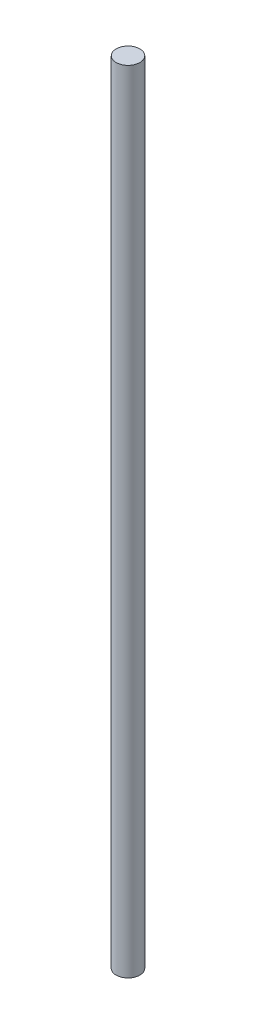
from build123d import *

# Parameters (mm, degrees)
SKETCH1_R           = 1.5
BOSS_EXTRUDE1_DEPTH = 100


with BuildPart() as part:
    # Sketch1 → Boss-Extrude1 (new body)
    with BuildSketch(Plane(origin=(0, 0, 0), x_dir=(1, 0, 0), z_dir=(0, 1, 0))):
        with Locations(Location((0, 0, 0), (0, 0, 270))):
            Circle(SKETCH1_R)
    extrude(amount=BOSS_EXTRUDE1_DEPTH)


solid = part.part
